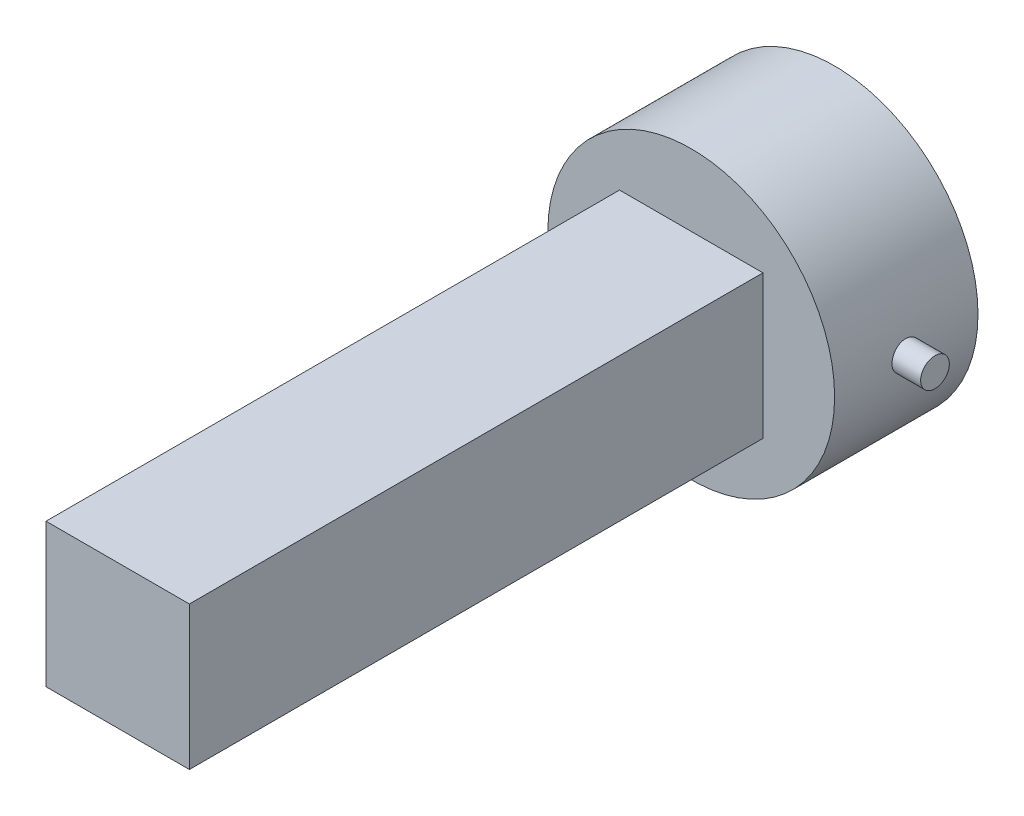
from build123d import *

# Parameters (mm, degrees)
SZKIC1_R                    = 50
DODANIE_WYCI_GNI_CIE1_DEPTH = 25
SZKIC2_W                    = 50
SZKIC2_H                    = 50
DODANIE_WYCI_GNI_CIE2_DEPTH = 200
SZKIC3_R                    = 5
DODANIE_WYCI_GNI_CIE3_DEPTH = 60


with BuildPart() as part:
    # Szkic1 → Dodanie-wyci_gni_cie1 (new, symmetric)
    with BuildSketch(Plane.XY):
        Circle(SZKIC1_R)
    extrude(amount=DODANIE_WYCI_GNI_CIE1_DEPTH, both=True)

    # Szkic2 → Dodanie-wyci_gni_cie2 (add)
    with BuildSketch(Plane.XY.offset(25)):
        Rectangle(SZKIC2_W, SZKIC2_H)
    extrude(amount=DODANIE_WYCI_GNI_CIE2_DEPTH)

    # Szkic3 → Dodanie-wyci_gni_cie3 (add)
    with BuildSketch(Plane(origin=(0, 0, 0), x_dir=(0, 0, -1), z_dir=(1, 0, 0))):
        Circle(SZKIC3_R)
    extrude(amount=DODANIE_WYCI_GNI_CIE3_DEPTH)


solid = part.part
